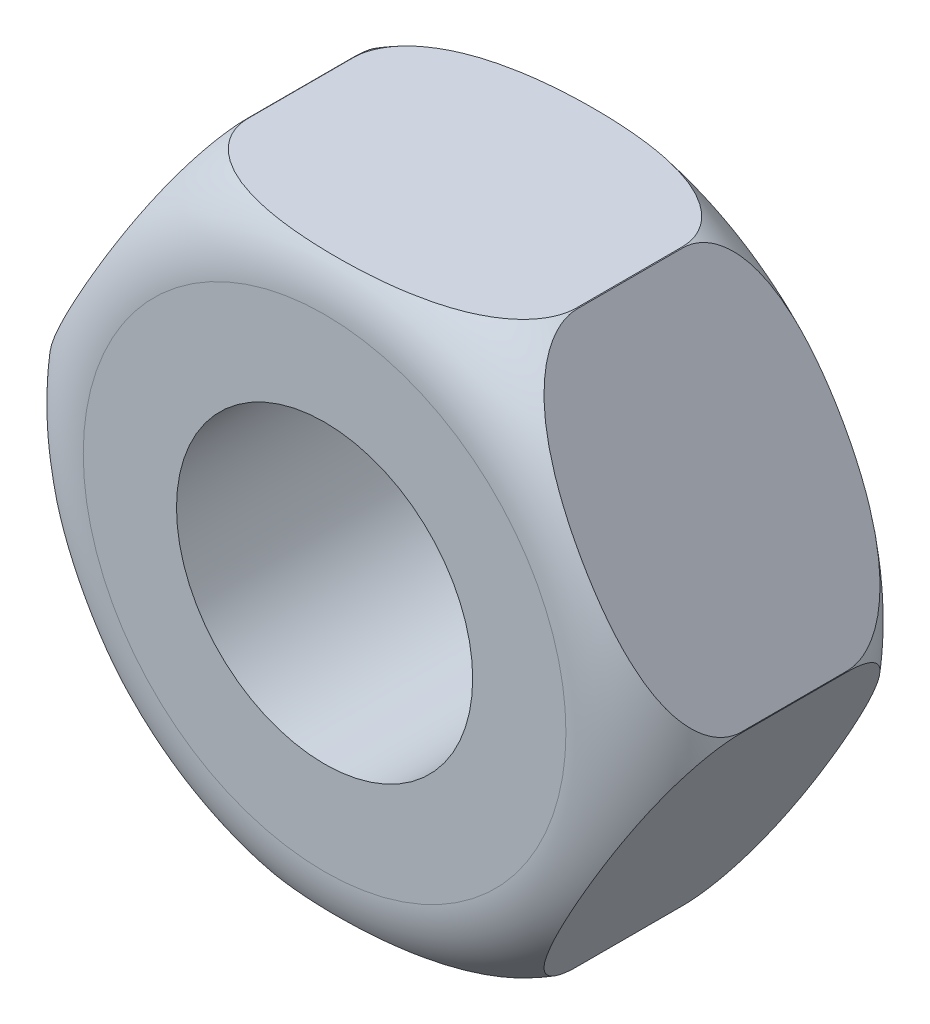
from build123d import *

# Parameters (mm, degrees)
ESQUISSE1_R             = 7.5
EXTRUSION1_DEPTH        = 6.4
CONG_1_R                = 2
ESQUISSE2_R             = 14.142135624
ENL_V_MAT_EXTRU_1_DEPTH = 13.387897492
ESQUISSE3_R             = 3.375
ENL_V_MAT_EXTRU_2_DEPTH = 12.809318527


with BuildPart() as part:
    # Esquisse1 → Extrusion1 (new body)
    with BuildSketch(Plane.XY):
        Circle(ESQUISSE1_R)
    extrude(amount=EXTRUSION1_DEPTH)

    # Cong_1
    cong_1_edges = [part.edges().sort_by_distance(p)[0] for p in [
        (-7.5, 0, 0),
        (-7.5, 0, 6.4),
    ]]
    fillet(cong_1_edges, radius=CONG_1_R)

    # Esquisse2 → Enl_v. mat.-Extru.1 (cut, through all)
    with BuildSketch(Plane.XY.offset(6.4)):
        Circle(ESQUISSE2_R)
        Polygon((7.505553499, 0), (3.75277675, 6.5), (-3.75277675, 6.5), (-7.505553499, 0), (-3.75277675, -6.5), (3.75277675, -6.5), align=None, mode=Mode.SUBTRACT)
    extrude(amount=-ENL_V_MAT_EXTRU_1_DEPTH, mode=Mode.SUBTRACT)

    # Esquisse3 → Enl_v. mat.-Extru.2 (cut, through all)
    with BuildSketch(Plane.XY.offset(6.4)):
        Circle(ESQUISSE3_R)
    extrude(amount=-ENL_V_MAT_EXTRU_2_DEPTH, mode=Mode.SUBTRACT)


solid = part.part
